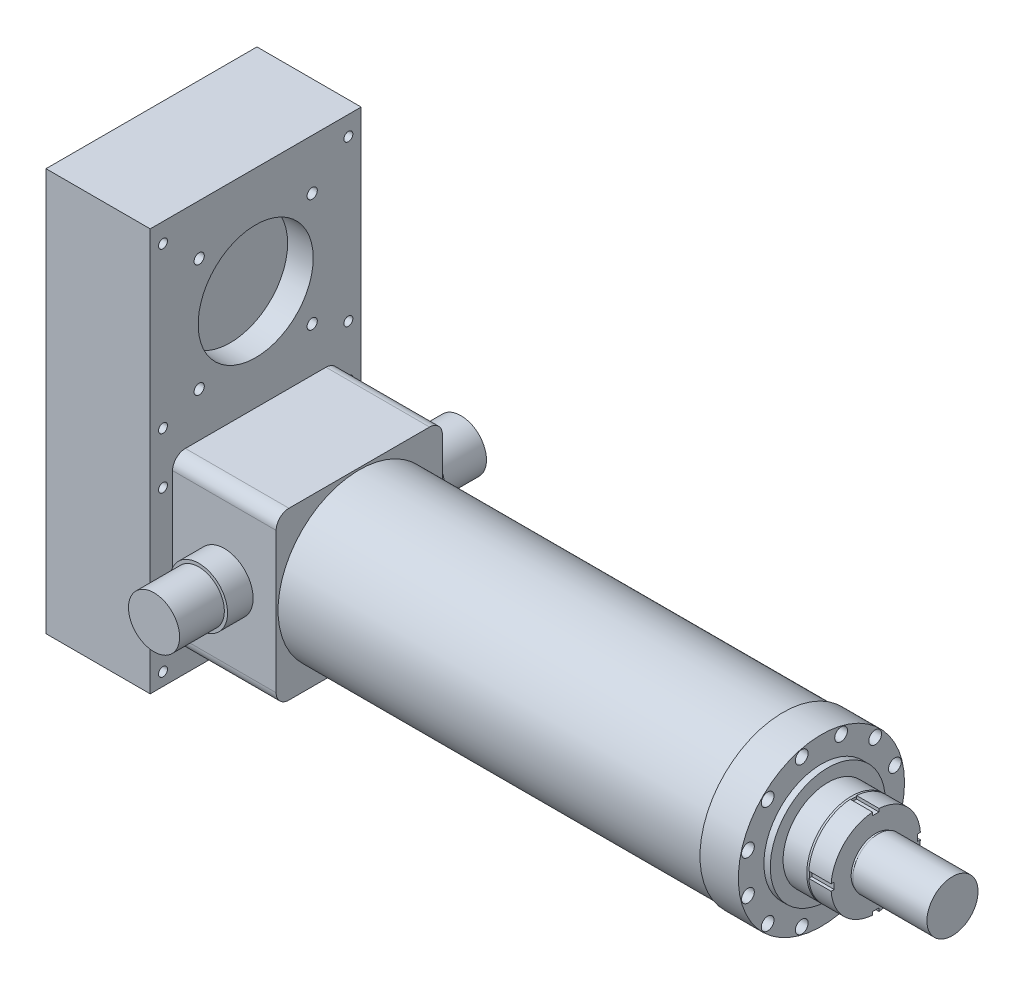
from build123d import *

# Parameters (mm, degrees)
SKETCH_1_R          = 127
SKETCH_1_R_2        = 110
EXTRUDE_1_DEPTH     = 663
SKETCH_2_R          = 130
EXTRUDE_2_DEPTH     = 60
SKETCH_3_R          = 90
EXTRUDE_3_DEPTH     = 10
SKETCH_5_R          = 70
EXTRUDE_4_DEPTH     = 40
CHAMFER_1_SIZE      = 3
CHAMFER_1_SIZE2     = 1.091910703
SKETCH_7_R          = 70
EXTRUDE_5_DEPTH     = 35
SKETCH_8_R          = 38.5
EXTRUDE_6_DEPTH     = 4
SKETCH_9_R          = 40
EXTRUDE_7_DEPTH     = 116
SKETCH_10_W         = 10
SKETCH_10_H         = 12.219318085
SKETCH_10_W_2       = 33.965202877
SKETCH_10_H_2       = 10
SKETCH_10_H_3       = 35.687535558
CUT_EXTRUDE_2_DEPTH = 35
EXTRUDE_8_DEPTH     = 162
SKETCH_12_W         = 330
SKETCH_12_H         = 630
EXTRUDE_9_DEPTH     = 163
SKETCH_14_R         = 90
SKETCH_14_R_2       = 8
SKETCH_14_R_3       = 7
CUT_EXTRUDE_3_DEPTH = 40
SKETCH_15_R         = 10
SKETCH_15_R_2       = 6.5
CUT_EXTRUDE_4_DEPTH = 20
SKETCH_15_3_R       = 6.5
CUT_EXTRUDE_5_DEPTH = 50
SKETCH_16_R         = 40
EXTRUDE_10_DEPTH    = 110
EXTRUDE_START       = -260
SKETCH_16_2_R       = 40
EXTRUDE_11_DEPTH    = 110
SKETCH_17_R         = 45
SKETCH_17_R_2       = 40
EXTRUDE_12_DEPTH    = 40
SKETCH_17_2_R       = 45
SKETCH_17_2_R_2     = 40
EXTRUDE_13_DEPTH    = 40


with BuildPart() as part:
    # Sketch 1 → Extrude 1 (new body)
    with BuildSketch(Plane(origin=(0, 0, 0), x_dir=(0, 0, -1), z_dir=(1, 0, 0))):
        Circle(SKETCH_1_R)
        Circle(SKETCH_1_R_2, mode=Mode.SUBTRACT)
    extrude(amount=EXTRUDE_1_DEPTH)


with BuildPart() as body_2:
    # Sketch 2 → Extrude 2 (new body)
    with BuildSketch(Plane(origin=(663, 0, 0), x_dir=(0, 0, -1), z_dir=(1, 0, 0))):
        Circle(SKETCH_2_R)
    extrude(amount=EXTRUDE_2_DEPTH)

    # Sketch 3 → Extrude 3 (add)
    with BuildSketch(Plane(origin=(723, 0, 0), x_dir=(0, 0, -1), z_dir=(1, 0, 0))):
        Circle(SKETCH_3_R)
    extrude(amount=EXTRUDE_3_DEPTH)

    # Sketch 5 → Extrude 4 (add)
    with BuildSketch(Plane(origin=(733, 0, 0), x_dir=(0, 0, -1), z_dir=(1, 0, 0))):
        Circle(SKETCH_5_R)
    extrude(amount=EXTRUDE_4_DEPTH)

    # Chamfer 1
    chamfer_1_edges = [body_2.edges().sort_by_distance(p)[0] for p in [
        (773, 0, 70),
    ]]
    chamfer_1_side = [body_2.faces().sort_by_distance(p)[0] for p in [
        (753, 0, 70),
    ]]
    chamfer(chamfer_1_edges, length=CHAMFER_1_SIZE, length2=CHAMFER_1_SIZE2, reference=chamfer_1_side[0])

    # Sketch 7 → Extrude 5 (add)
    with BuildSketch(Plane(origin=(773, 0, 0), x_dir=(0, 0, -1), z_dir=(1, 0, 0))):
        Circle(SKETCH_7_R)
    extrude(amount=EXTRUDE_5_DEPTH)

    # Sketch 8 → Extrude 6 (add)
    with BuildSketch(Plane(origin=(808, 0, 0), x_dir=(0, 0, -1), z_dir=(1, 0, 0))):
        Circle(SKETCH_8_R)
    extrude(amount=EXTRUDE_6_DEPTH)

    # Sketch 9 → Extrude 7 (add)
    with BuildSketch(Plane(origin=(812, 0, 0), x_dir=(0, 0, -1), z_dir=(1, 0, 0))):
        with Locations(Location((0, 0, 0), (0, 0, 180))):
            Circle(SKETCH_9_R)
    extrude(amount=EXTRUDE_7_DEPTH)

    # Sketch 10 → Cut-Extrude 2 (cut)
    with BuildSketch(Plane(origin=(808, 0, 0), x_dir=(0, 0, -1), z_dir=(1, 0, 0))):
        with Locations((0, -71.109659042)):
            Rectangle(SKETCH_10_W, SKETCH_10_H)
        Polygon((-76.465931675, 5), (-65, 5), (-65, -5), (-79.460488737, -5), align=None)
        with Locations((81.982601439, 0)):
            Rectangle(SKETCH_10_W_2, SKETCH_10_H_2)
        with Locations((0, 82.843767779)):
            Rectangle(SKETCH_10_W, SKETCH_10_H_3)
    extrude(amount=-CUT_EXTRUDE_2_DEPTH, mode=Mode.SUBTRACT)

    # Sketch 15 → Cut-Extrude 4 (cut)
    # profile 1 of 12: a face of its own
    with BuildSketch(Plane(origin=(723, 0, 0), x_dir=(0, 0, -1), z_dir=(1, 0, 0))):
        with Locations((-84.145706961, 84.145706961)):
            Circle(SKETCH_15_R)
        with Locations((-84.145706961, 84.145706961)):
            Circle(SKETCH_15_R_2, mode=Mode.SUBTRACT)
    # profile 2 of 12: a face of its own
    with BuildSketch(Plane(origin=(723, 0, 0), x_dir=(0, 0, -1), z_dir=(1, 0, 0))):
        with Locations((30.799466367, 114.945173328)):
            Circle(SKETCH_15_R)
    # profile 3 of 12: a face of its own
    with BuildSketch(Plane(origin=(723, 0, 0), x_dir=(0, 0, -1), z_dir=(1, 0, 0))):
        with Locations((84.145706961, 84.145706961)):
            Circle(SKETCH_15_R)
    # profile 4 of 12: a face of its own
    with BuildSketch(Plane(origin=(723, 0, 0), x_dir=(0, 0, -1), z_dir=(1, 0, 0))):
        with Locations((-30.799466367, 114.945173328)):
            Circle(SKETCH_15_R)
    # profile 5 of 12: a face of its own
    with BuildSketch(Plane(origin=(723, 0, 0), x_dir=(0, 0, -1), z_dir=(1, 0, 0))):
        with Locations((-114.945173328, 30.799466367)):
            Circle(SKETCH_15_R)
    # profile 6 of 12: a face of its own
    with BuildSketch(Plane(origin=(723, 0, 0), x_dir=(0, 0, -1), z_dir=(1, 0, 0))):
        with Locations((-114.945173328, -30.799466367)):
            Circle(SKETCH_15_R)
    # profile 7 of 12: a face of its own
    with BuildSketch(Plane(origin=(723, 0, 0), x_dir=(0, 0, -1), z_dir=(1, 0, 0))):
        with Locations((-84.145706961, -84.145706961)):
            Circle(SKETCH_15_R)
    # profile 8 of 12: a face of its own
    with BuildSketch(Plane(origin=(723, 0, 0), x_dir=(0, 0, -1), z_dir=(1, 0, 0))):
        with Locations((-30.799466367, -114.945173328)):
            Circle(SKETCH_15_R)
    # profile 9 of 12: a face of its own
    with BuildSketch(Plane(origin=(723, 0, 0), x_dir=(0, 0, -1), z_dir=(1, 0, 0))):
        with Locations((30.799466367, -114.945173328)):
            Circle(SKETCH_15_R)
    # profile 10 of 12: a face of its own
    with BuildSketch(Plane(origin=(723, 0, 0), x_dir=(0, 0, -1), z_dir=(1, 0, 0))):
        with Locations((84.145706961, -84.145706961)):
            Circle(SKETCH_15_R)
    # profile 11 of 12: a face of its own
    with BuildSketch(Plane(origin=(723, 0, 0), x_dir=(0, 0, -1), z_dir=(1, 0, 0))):
        with Locations((114.945173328, -30.799466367)):
            Circle(SKETCH_15_R)
    # profile 12 of 12: a face of its own
    with BuildSketch(Plane(origin=(723, 0, 0), x_dir=(0, 0, -1), z_dir=(1, 0, 0))):
        with Locations((114.945173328, 30.799466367)):
            Circle(SKETCH_15_R)
    extrude(amount=-CUT_EXTRUDE_4_DEPTH, mode=Mode.SUBTRACT)

    # Sketch 15_3 → Cut-Extrude 5 (cut)
    with BuildSketch(Plane(origin=(723, 0, 0), x_dir=(0, 0, -1), z_dir=(1, 0, 0))):
        with Locations((30.799466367, 114.945173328)):
            Circle(SKETCH_15_3_R)
        with Locations((84.145706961, 84.145706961)):
            Circle(SKETCH_15_3_R)
        with Locations((114.945173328, 30.799466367)):
            Circle(SKETCH_15_3_R)
        with Locations((114.945173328, -30.799466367)):
            Circle(SKETCH_15_3_R)
        with Locations((84.145706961, -84.145706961)):
            Circle(SKETCH_15_3_R)
        with Locations((30.799466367, -114.945173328)):
            Circle(SKETCH_15_3_R)
        with Locations((-30.799466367, -114.945173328)):
            Circle(SKETCH_15_3_R)
        with Locations((-84.145706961, -84.145706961)):
            Circle(SKETCH_15_3_R)
        with Locations((-114.945173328, -30.799466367)):
            Circle(SKETCH_15_3_R)
        with Locations((-114.945173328, 30.799466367)):
            Circle(SKETCH_15_3_R)
        with Locations((-84.145706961, 84.145706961)):
            Circle(SKETCH_15_3_R)
        with Locations((-30.799466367, 114.945173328)):
            Circle(SKETCH_15_3_R)
    extrude(amount=-CUT_EXTRUDE_5_DEPTH, mode=Mode.SUBTRACT)


with BuildPart() as body_3:
    # Sketch 11 → Extrude 8 (new body)
    with BuildSketch(Plane.ZY):
        with BuildLine():
            Line((-110, 130), (110, 130))
            ThreePointArc((110, 130), (124.142135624, 124.142135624), (130, 110))
            Line((130, 110), (130, -110))
            ThreePointArc((130, -110), (124.142135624, -124.142135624), (110, -130))
            Line((110, -130), (-110, -130))
            ThreePointArc((-110, -130), (-124.142135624, -124.142135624), (-130, -110))
            Line((-130, -110), (-130, 110))
            ThreePointArc((-130, 110), (-124.142135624, 124.142135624), (-110, 130))
        make_face()
    extrude(amount=EXTRUDE_8_DEPTH)

    # Sketch 16 → Extrude 10 (add)
    with BuildSketch(Plane.XY.offset(130)):
        with Locations(Location((-81, 0, 0), (0, 0, 90))):
            Circle(SKETCH_16_R)
    extrude(amount=EXTRUDE_10_DEPTH)

    # Sketch 16_2 → Extrude 11 (add)
    with BuildSketch(Plane.XY.offset(130).offset(EXTRUDE_START)):
        with Locations(Location((-81, 0, 0), (0, 0, 90))):
            Circle(SKETCH_16_2_R)
    extrude(amount=-EXTRUDE_11_DEPTH)

    # Sketch 17 → Extrude 12 (add)
    with BuildSketch(Plane.XY.offset(130)):
        with Locations(Location((-81, 0, 0), (0, 0, 90))):
            Circle(SKETCH_17_R)
        with Locations((-81, 0)):
            Circle(SKETCH_17_R_2, mode=Mode.SUBTRACT)
    extrude(amount=EXTRUDE_12_DEPTH)

    # Sketch 17_2 → Extrude 13 (add)
    with BuildSketch(Plane.XY.offset(130).offset(EXTRUDE_START)):
        with Locations(Location((-81, 0, 0), (0, 0, 90))):
            Circle(SKETCH_17_2_R)
        with Locations((-81, 0)):
            Circle(SKETCH_17_2_R_2, mode=Mode.SUBTRACT)
    extrude(amount=-EXTRUDE_13_DEPTH)


with BuildPart() as body_4:
    # Sketch 12 → Extrude 9 (new body)
    with BuildSketch(Plane.ZY.offset(162)):
        with Locations((0, 140)):
            Rectangle(SKETCH_12_W, SKETCH_12_H)
    extrude(amount=EXTRUDE_9_DEPTH)

    # Sketch 14 → Cut-Extrude 3 (cut)
    with BuildSketch(Plane(origin=(-162, 0, 0), x_dir=(0, 0, -1), z_dir=(1, 0, 0))):
        with Locations((0, 288)):
            Circle(SKETCH_14_R)
        with Locations((-88.388347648, 376.388347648)):
            Circle(SKETCH_14_R_2)
        with Locations((88.388347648, 376.388347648)):
            Circle(SKETCH_14_R_2)
        with Locations((88.388347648, 199.611652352)):
            Circle(SKETCH_14_R_2)
        with Locations((-88.388347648, 199.611652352)):
            Circle(SKETCH_14_R_2)
        with Locations((-145, 175)):
            Circle(SKETCH_14_R_3)
        with Locations((-145, 94.5)):
            Circle(SKETCH_14_R_3)
        with Locations((-145, -94.5)):
            Circle(SKETCH_14_R_3)
        with Locations((-145, -155)):
            Circle(SKETCH_14_R_3)
        with Locations((-145, 425)):
            Circle(SKETCH_14_R_3)
        with Locations(Location((145, -155, 0), (0, 0, 180))):
            Circle(SKETCH_14_R_3)
        with Locations(Location((145, -94.5, 0), (0, 0, 180))):
            Circle(SKETCH_14_R_3)
        with Locations(Location((145, 94.5, 0), (0, 0, 180))):
            Circle(SKETCH_14_R_3)
        with Locations(Location((145, 175, 0), (0, 0, 180))):
            Circle(SKETCH_14_R_3)
        with Locations(Location((145, 425, 0), (0, 0, 180))):
            Circle(SKETCH_14_R_3)
    extrude(amount=-CUT_EXTRUDE_3_DEPTH, mode=Mode.SUBTRACT)


solid = Compound([part.part, body_2.part, body_3.part, body_4.part])
